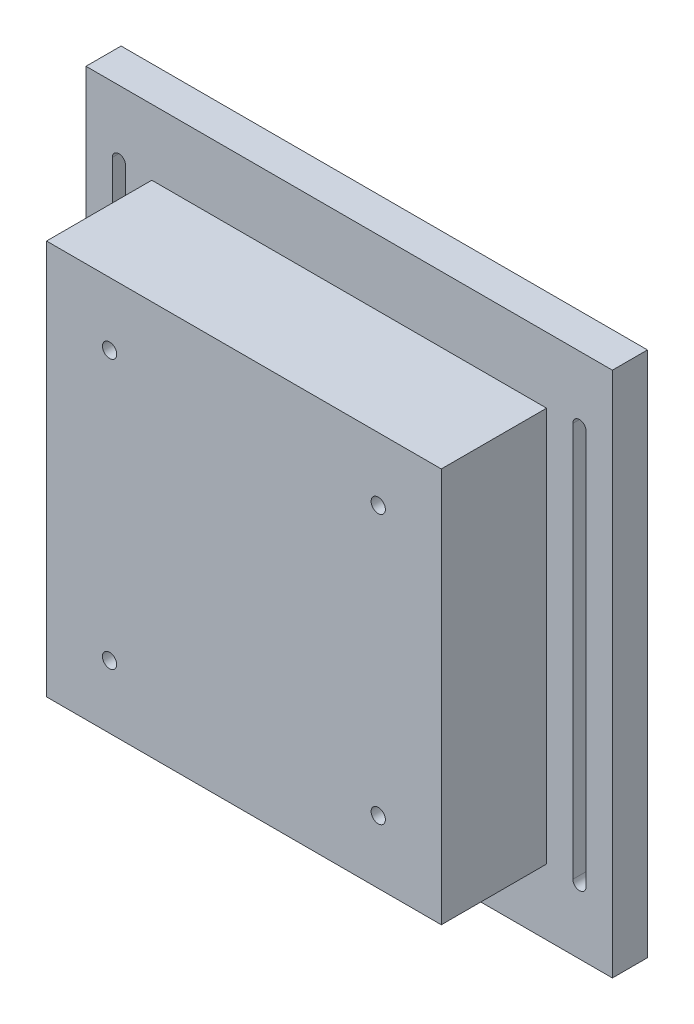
ISO-10303-21;
HEADER;
FILE_DESCRIPTION(('STEP AP214'),'2;1');
FILE_NAME('part.step','',(''),(''),'','','');
FILE_SCHEMA(('AUTOMOTIVE_DESIGN { 1 0 10303 214 1 1 1 1 }'));
ENDSEC;
DATA;
#1=APPLICATION_CONTEXT('core data for automotive mechanical design processes');
#2=APPLICATION_PROTOCOL_DEFINITION('international standard','automotive_design',2000,#1);
#3=PRODUCT_CONTEXT('',#1,'mechanical');
#4=PRODUCT('Part','Part','',(#3));
#5=PRODUCT_RELATED_PRODUCT_CATEGORY('part','',(#4));
#6=PRODUCT_DEFINITION_FORMATION('','',#4);
#7=PRODUCT_DEFINITION_CONTEXT('part definition',#1,'design');
#8=PRODUCT_DEFINITION('design','',#6,#7);
#9=PRODUCT_DEFINITION_SHAPE('','',#8);
#10=(LENGTH_UNIT() NAMED_UNIT(*) SI_UNIT(.MILLI.,.METRE.));
#11=(NAMED_UNIT(*) PLANE_ANGLE_UNIT() SI_UNIT($,.RADIAN.));
#12=(NAMED_UNIT(*) SI_UNIT($,.STERADIAN.) SOLID_ANGLE_UNIT());
#13=UNCERTAINTY_MEASURE_WITH_UNIT(LENGTH_MEASURE(1.E-05),#10,'distance_accuracy_value','');
#14=(GEOMETRIC_REPRESENTATION_CONTEXT(3) GLOBAL_UNCERTAINTY_ASSIGNED_CONTEXT((#13)) GLOBAL_UNIT_ASSIGNED_CONTEXT((#10,
#11,#12)) REPRESENTATION_CONTEXT('',''));
#15=CARTESIAN_POINT('',(0.,0.,0.));
#16=DIRECTION('',(0.,0.,1.));
#17=DIRECTION('',(1.,0.,0.));
#18=AXIS2_PLACEMENT_3D('',#15,#16,#17);
#19=CARTESIAN_POINT('',(0.,0.,16.));
#20=DIRECTION('',(0.,0.,-1.));
#21=DIRECTION('',(-1.,0.,0.));
#22=AXIS2_PLACEMENT_3D('',#19,#20,#21);
#23=PLANE('',#22);
#24=DIRECTION('',(0.,-1.,0.));
#25=VECTOR('',#24,1.);
#26=CARTESIAN_POINT('',(222.,210.,16.));
#27=LINE('',#26,#25);
#28=CARTESIAN_POINT('',(222.,210.,16.));
#29=VERTEX_POINT('',#28);
#30=CARTESIAN_POINT('',(222.,30.,16.));
#31=VERTEX_POINT('',#30);
#32=EDGE_CURVE('E189',#29,#31,#27,.T.);
#33=ORIENTED_EDGE('',*,*,#32,.F.);
#34=CARTESIAN_POINT('',(225.,210.,16.));
#35=DIRECTION('',(0.,0.,1.));
#36=DIRECTION('',(-1.,0.,0.));
#37=AXIS2_PLACEMENT_3D('',#34,#35,#36);
#38=CIRCLE('',#37,3.);
#39=CARTESIAN_POINT('',(228.,210.,16.));
#40=VERTEX_POINT('',#39);
#41=EDGE_CURVE('E48',#40,#29,#38,.T.);
#42=ORIENTED_EDGE('',*,*,#41,.F.);
#43=DIRECTION('',(0.,1.,0.));
#44=VECTOR('',#43,1.);
#45=CARTESIAN_POINT('',(228.,210.,16.));
#46=LINE('',#45,#44);
#47=CARTESIAN_POINT('',(228.,30.,16.));
#48=VERTEX_POINT('',#47);
#49=EDGE_CURVE('E182',#48,#40,#46,.T.);
#50=ORIENTED_EDGE('',*,*,#49,.F.);
#51=CARTESIAN_POINT('',(225.,30.,16.));
#52=DIRECTION('',(0.,0.,1.));
#53=DIRECTION('',(-1.,0.,0.));
#54=AXIS2_PLACEMENT_3D('',#51,#52,#53);
#55=CIRCLE('',#54,3.);
#56=EDGE_CURVE('E196',#31,#48,#55,.T.);
#57=ORIENTED_EDGE('',*,*,#56,.F.);
#58=EDGE_LOOP('',(#33,#42,#50,#57));
#59=FACE_BOUND('',#58,.T.);
#60=DIRECTION('',(0.,-1.,0.));
#61=VECTOR('',#60,1.);
#62=CARTESIAN_POINT('',(12.,210.,16.));
#63=LINE('',#62,#61);
#64=CARTESIAN_POINT('',(12.,210.,16.));
#65=VERTEX_POINT('',#64);
#66=CARTESIAN_POINT('',(12.,30.,16.));
#67=VERTEX_POINT('',#66);
#68=EDGE_CURVE('E215',#65,#67,#63,.T.);
#69=ORIENTED_EDGE('',*,*,#68,.F.);
#70=CARTESIAN_POINT('',(15.,210.,16.));
#71=DIRECTION('',(0.,0.,1.));
#72=DIRECTION('',(1.,0.,0.));
#73=AXIS2_PLACEMENT_3D('',#70,#71,#72);
#74=CIRCLE('',#73,3.);
#75=CARTESIAN_POINT('',(18.,210.,16.));
#76=VERTEX_POINT('',#75);
#77=EDGE_CURVE('E213',#76,#65,#74,.T.);
#78=ORIENTED_EDGE('',*,*,#77,.F.);
#79=DIRECTION('',(0.,1.,0.));
#80=VECTOR('',#79,1.);
#81=CARTESIAN_POINT('',(18.,210.,16.));
#82=LINE('',#81,#80);
#83=CARTESIAN_POINT('',(18.,30.,16.));
#84=VERTEX_POINT('',#83);
#85=EDGE_CURVE('E221',#84,#76,#82,.T.);
#86=ORIENTED_EDGE('',*,*,#85,.F.);
#87=CARTESIAN_POINT('',(15.,30.,16.));
#88=DIRECTION('',(0.,0.,1.));
#89=DIRECTION('',(1.,0.,0.));
#90=AXIS2_PLACEMENT_3D('',#87,#88,#89);
#91=CIRCLE('',#90,3.);
#92=EDGE_CURVE('E218',#67,#84,#91,.T.);
#93=ORIENTED_EDGE('',*,*,#92,.F.);
#94=EDGE_LOOP('',(#69,#78,#86,#93));
#95=FACE_BOUND('',#94,.T.);
#96=DIRECTION('',(0.,-1.,0.));
#97=VECTOR('',#96,1.);
#98=CARTESIAN_POINT('',(0.,0.,16.));
#99=LINE('',#98,#97);
#100=CARTESIAN_POINT('',(0.,240.,16.));
#101=VERTEX_POINT('',#100);
#102=CARTESIAN_POINT('',(0.,0.,16.));
#103=VERTEX_POINT('',#102);
#104=EDGE_CURVE('E302',#101,#103,#99,.T.);
#105=ORIENTED_EDGE('',*,*,#104,.T.);
#106=DIRECTION('',(1.,0.,0.));
#107=VECTOR('',#106,1.);
#108=CARTESIAN_POINT('',(0.,0.,16.));
#109=LINE('',#108,#107);
#110=CARTESIAN_POINT('',(240.,0.,16.));
#111=VERTEX_POINT('',#110);
#112=EDGE_CURVE('E305',#103,#111,#109,.T.);
#113=ORIENTED_EDGE('',*,*,#112,.T.);
#114=DIRECTION('',(0.,1.,0.));
#115=VECTOR('',#114,1.);
#116=CARTESIAN_POINT('',(240.,0.,16.));
#117=LINE('',#116,#115);
#118=CARTESIAN_POINT('',(240.,240.,16.));
#119=VERTEX_POINT('',#118);
#120=EDGE_CURVE('E308',#111,#119,#117,.T.);
#121=ORIENTED_EDGE('',*,*,#120,.T.);
#122=DIRECTION('',(-1.,0.,0.));
#123=VECTOR('',#122,1.);
#124=CARTESIAN_POINT('',(0.,240.,16.));
#125=LINE('',#124,#123);
#126=EDGE_CURVE('E310',#119,#101,#125,.T.);
#127=ORIENTED_EDGE('',*,*,#126,.T.);
#128=EDGE_LOOP('',(#105,#113,#121,#127));
#129=FACE_BOUND('',#128,.T.);
#130=DIRECTION('',(0.,-1.,0.));
#131=VECTOR('',#130,1.);
#132=CARTESIAN_POINT('',(30.,30.,16.));
#133=LINE('',#132,#131);
#134=CARTESIAN_POINT('',(30.,210.,16.));
#135=VERTEX_POINT('',#134);
#136=CARTESIAN_POINT('',(30.,30.,16.));
#137=VERTEX_POINT('',#136);
#138=EDGE_CURVE('E262',#135,#137,#133,.T.);
#139=ORIENTED_EDGE('',*,*,#138,.F.);
#140=DIRECTION('',(-1.,0.,0.));
#141=VECTOR('',#140,1.);
#142=CARTESIAN_POINT('',(30.,210.,16.));
#143=LINE('',#142,#141);
#144=CARTESIAN_POINT('',(210.,210.,16.));
#145=VERTEX_POINT('',#144);
#146=EDGE_CURVE('E273',#145,#135,#143,.T.);
#147=ORIENTED_EDGE('',*,*,#146,.F.);
#148=DIRECTION('',(0.,1.,0.));
#149=VECTOR('',#148,1.);
#150=CARTESIAN_POINT('',(210.,30.,16.));
#151=LINE('',#150,#149);
#152=CARTESIAN_POINT('',(210.,30.,16.));
#153=VERTEX_POINT('',#152);
#154=EDGE_CURVE('E285',#153,#145,#151,.T.);
#155=ORIENTED_EDGE('',*,*,#154,.F.);
#156=DIRECTION('',(1.,0.,0.));
#157=VECTOR('',#156,1.);
#158=CARTESIAN_POINT('',(30.,30.,16.));
#159=LINE('',#158,#157);
#160=EDGE_CURVE('E282',#137,#153,#159,.T.);
#161=ORIENTED_EDGE('',*,*,#160,.F.);
#162=EDGE_LOOP('',(#139,#147,#155,#161));
#163=FACE_BOUND('',#162,.T.);
#164=ADVANCED_FACE('F33',(#59,#95,#129,#163),#23,.F.);
#165=CARTESIAN_POINT('',(0.,0.,16.));
#166=DIRECTION('',(1.,0.,0.));
#167=DIRECTION('',(0.,0.,-1.));
#168=AXIS2_PLACEMENT_3D('',#165,#166,#167);
#169=PLANE('',#168);
#170=DIRECTION('',(0.,-1.,0.));
#171=VECTOR('',#170,1.);
#172=CARTESIAN_POINT('',(0.,0.,0.));
#173=LINE('',#172,#171);
#174=CARTESIAN_POINT('',(0.,240.,0.));
#175=VERTEX_POINT('',#174);
#176=CARTESIAN_POINT('',(0.,0.,0.));
#177=VERTEX_POINT('',#176);
#178=EDGE_CURVE('E301',#175,#177,#173,.T.);
#179=ORIENTED_EDGE('',*,*,#178,.T.);
#180=DIRECTION('',(0.,0.,-1.));
#181=VECTOR('',#180,1.);
#182=CARTESIAN_POINT('',(0.,0.,16.));
#183=LINE('',#182,#181);
#184=EDGE_CURVE('E11',#103,#177,#183,.T.);
#185=ORIENTED_EDGE('',*,*,#184,.F.);
#186=ORIENTED_EDGE('',*,*,#104,.F.);
#187=DIRECTION('',(0.,0.,-1.));
#188=VECTOR('',#187,1.);
#189=CARTESIAN_POINT('',(0.,240.,16.));
#190=LINE('',#189,#188);
#191=EDGE_CURVE('E312',#101,#175,#190,.T.);
#192=ORIENTED_EDGE('',*,*,#191,.T.);
#193=EDGE_LOOP('',(#179,#185,#186,#192));
#194=FACE_BOUND('',#193,.T.);
#195=ADVANCED_FACE('F35',(#194),#169,.F.);
#196=CARTESIAN_POINT('',(0.,0.,16.));
#197=DIRECTION('',(0.,1.,0.));
#198=DIRECTION('',(0.,0.,1.));
#199=AXIS2_PLACEMENT_3D('',#196,#197,#198);
#200=PLANE('',#199);
#201=DIRECTION('',(1.,0.,0.));
#202=VECTOR('',#201,1.);
#203=CARTESIAN_POINT('',(0.,0.,0.));
#204=LINE('',#203,#202);
#205=CARTESIAN_POINT('',(240.,0.,0.));
#206=VERTEX_POINT('',#205);
#207=EDGE_CURVE('E315',#177,#206,#204,.T.);
#208=ORIENTED_EDGE('',*,*,#207,.T.);
#209=DIRECTION('',(0.,0.,-1.));
#210=VECTOR('',#209,1.);
#211=CARTESIAN_POINT('',(240.,0.,16.));
#212=LINE('',#211,#210);
#213=EDGE_CURVE('E41',#111,#206,#212,.T.);
#214=ORIENTED_EDGE('',*,*,#213,.F.);
#215=ORIENTED_EDGE('',*,*,#112,.F.);
#216=ORIENTED_EDGE('',*,*,#184,.T.);
#217=EDGE_LOOP('',(#208,#214,#215,#216));
#218=FACE_BOUND('',#217,.T.);
#219=ADVANCED_FACE('F344',(#218),#200,.F.);
#220=CARTESIAN_POINT('',(240.,0.,16.));
#221=DIRECTION('',(-1.,0.,0.));
#222=DIRECTION('',(0.,0.,1.));
#223=AXIS2_PLACEMENT_3D('',#220,#221,#222);
#224=PLANE('',#223);
#225=DIRECTION('',(0.,1.,0.));
#226=VECTOR('',#225,1.);
#227=CARTESIAN_POINT('',(240.,0.,0.));
#228=LINE('',#227,#226);
#229=CARTESIAN_POINT('',(240.,240.,0.));
#230=VERTEX_POINT('',#229);
#231=EDGE_CURVE('E317',#206,#230,#228,.T.);
#232=ORIENTED_EDGE('',*,*,#231,.T.);
#233=DIRECTION('',(0.,0.,-1.));
#234=VECTOR('',#233,1.);
#235=CARTESIAN_POINT('',(240.,240.,16.));
#236=LINE('',#235,#234);
#237=EDGE_CURVE('E322',#119,#230,#236,.T.);
#238=ORIENTED_EDGE('',*,*,#237,.F.);
#239=ORIENTED_EDGE('',*,*,#120,.F.);
#240=ORIENTED_EDGE('',*,*,#213,.T.);
#241=EDGE_LOOP('',(#232,#238,#239,#240));
#242=FACE_BOUND('',#241,.T.);
#243=ADVANCED_FACE('F329',(#242),#224,.F.);
#244=CARTESIAN_POINT('',(0.,240.,16.));
#245=DIRECTION('',(0.,-1.,0.));
#246=DIRECTION('',(0.,0.,-1.));
#247=AXIS2_PLACEMENT_3D('',#244,#245,#246);
#248=PLANE('',#247);
#249=DIRECTION('',(-1.,0.,0.));
#250=VECTOR('',#249,1.);
#251=CARTESIAN_POINT('',(0.,240.,0.));
#252=LINE('',#251,#250);
#253=EDGE_CURVE('E306',#230,#175,#252,.T.);
#254=ORIENTED_EDGE('',*,*,#253,.T.);
#255=ORIENTED_EDGE('',*,*,#191,.F.);
#256=ORIENTED_EDGE('',*,*,#126,.F.);
#257=ORIENTED_EDGE('',*,*,#237,.T.);
#258=EDGE_LOOP('',(#254,#255,#256,#257));
#259=FACE_BOUND('',#258,.T.);
#260=ADVANCED_FACE('F337',(#259),#248,.F.);
#261=CARTESIAN_POINT('',(0.,0.,0.));
#262=DIRECTION('',(0.,0.,-1.));
#263=DIRECTION('',(-1.,0.,0.));
#264=AXIS2_PLACEMENT_3D('',#261,#262,#263);
#265=PLANE('',#264);
#266=CARTESIAN_POINT('',(225.,210.,0.));
#267=DIRECTION('',(0.,0.,-1.));
#268=DIRECTION('',(-1.,0.,0.));
#269=AXIS2_PLACEMENT_3D('',#266,#267,#268);
#270=CIRCLE('',#269,3.);
#271=CARTESIAN_POINT('',(228.,210.,0.));
#272=VERTEX_POINT('',#271);
#273=CARTESIAN_POINT('',(222.,210.,0.));
#274=VERTEX_POINT('',#273);
#275=EDGE_CURVE('E180',#272,#274,#270,.F.);
#276=ORIENTED_EDGE('',*,*,#275,.T.);
#277=DIRECTION('',(0.,-1.,0.));
#278=VECTOR('',#277,1.);
#279=CARTESIAN_POINT('',(222.,210.,0.));
#280=LINE('',#279,#278);
#281=CARTESIAN_POINT('',(222.,30.,0.));
#282=VERTEX_POINT('',#281);
#283=EDGE_CURVE('E169',#274,#282,#280,.T.);
#284=ORIENTED_EDGE('',*,*,#283,.T.);
#285=CARTESIAN_POINT('',(225.,30.,0.));
#286=DIRECTION('',(0.,0.,-1.));
#287=DIRECTION('',(-1.,0.,0.));
#288=AXIS2_PLACEMENT_3D('',#285,#286,#287);
#289=CIRCLE('',#288,3.);
#290=CARTESIAN_POINT('',(228.,30.,0.));
#291=VERTEX_POINT('',#290);
#292=EDGE_CURVE('E191',#282,#291,#289,.F.);
#293=ORIENTED_EDGE('',*,*,#292,.T.);
#294=DIRECTION('',(0.,1.,0.));
#295=VECTOR('',#294,1.);
#296=CARTESIAN_POINT('',(228.,210.,0.));
#297=LINE('',#296,#295);
#298=EDGE_CURVE('E187',#291,#272,#297,.T.);
#299=ORIENTED_EDGE('',*,*,#298,.T.);
#300=EDGE_LOOP('',(#276,#284,#293,#299));
#301=FACE_BOUND('',#300,.T.);
#302=CARTESIAN_POINT('',(15.,210.,0.));
#303=DIRECTION('',(0.,0.,-1.));
#304=DIRECTION('',(-1.,0.,0.));
#305=AXIS2_PLACEMENT_3D('',#302,#303,#304);
#306=CIRCLE('',#305,3.);
#307=CARTESIAN_POINT('',(18.,210.,0.));
#308=VERTEX_POINT('',#307);
#309=CARTESIAN_POINT('',(12.,210.,0.));
#310=VERTEX_POINT('',#309);
#311=EDGE_CURVE('E210',#308,#310,#306,.F.);
#312=ORIENTED_EDGE('',*,*,#311,.T.);
#313=DIRECTION('',(0.,-1.,0.));
#314=VECTOR('',#313,1.);
#315=CARTESIAN_POINT('',(12.,210.,0.));
#316=LINE('',#315,#314);
#317=CARTESIAN_POINT('',(12.,30.,0.));
#318=VERTEX_POINT('',#317);
#319=EDGE_CURVE('E227',#310,#318,#316,.T.);
#320=ORIENTED_EDGE('',*,*,#319,.T.);
#321=CARTESIAN_POINT('',(15.,30.,0.));
#322=DIRECTION('',(0.,0.,-1.));
#323=DIRECTION('',(-1.,0.,0.));
#324=AXIS2_PLACEMENT_3D('',#321,#322,#323);
#325=CIRCLE('',#324,3.);
#326=CARTESIAN_POINT('',(18.,30.,0.));
#327=VERTEX_POINT('',#326);
#328=EDGE_CURVE('E176',#318,#327,#325,.F.);
#329=ORIENTED_EDGE('',*,*,#328,.T.);
#330=DIRECTION('',(0.,1.,0.));
#331=VECTOR('',#330,1.);
#332=CARTESIAN_POINT('',(18.,210.,0.));
#333=LINE('',#332,#331);
#334=EDGE_CURVE('E207',#327,#308,#333,.T.);
#335=ORIENTED_EDGE('',*,*,#334,.T.);
#336=EDGE_LOOP('',(#312,#320,#329,#335));
#337=FACE_BOUND('',#336,.T.);
#338=DIRECTION('',(0.,-1.,0.));
#339=VECTOR('',#338,1.);
#340=CARTESIAN_POINT('',(200.,200.,0.));
#341=LINE('',#340,#339);
#342=CARTESIAN_POINT('',(200.,200.,0.));
#343=VERTEX_POINT('',#342);
#344=CARTESIAN_POINT('',(200.,40.,0.));
#345=VERTEX_POINT('',#344);
#346=EDGE_CURVE('E236',#343,#345,#341,.T.);
#347=ORIENTED_EDGE('',*,*,#346,.F.);
#348=DIRECTION('',(1.,0.,0.));
#349=VECTOR('',#348,1.);
#350=CARTESIAN_POINT('',(200.,200.,0.));
#351=LINE('',#350,#349);
#352=CARTESIAN_POINT('',(40.,200.,0.));
#353=VERTEX_POINT('',#352);
#354=EDGE_CURVE('E241',#353,#343,#351,.T.);
#355=ORIENTED_EDGE('',*,*,#354,.F.);
#356=DIRECTION('',(0.,1.,0.));
#357=VECTOR('',#356,1.);
#358=CARTESIAN_POINT('',(40.,200.,0.));
#359=LINE('',#358,#357);
#360=CARTESIAN_POINT('',(40.0000000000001,40.,0.));
#361=VERTEX_POINT('',#360);
#362=EDGE_CURVE('E255',#361,#353,#359,.T.);
#363=ORIENTED_EDGE('',*,*,#362,.F.);
#364=DIRECTION('',(-1.,0.,0.));
#365=VECTOR('',#364,1.);
#366=CARTESIAN_POINT('',(200.,40.,0.));
#367=LINE('',#366,#365);
#368=EDGE_CURVE('E252',#345,#361,#367,.T.);
#369=ORIENTED_EDGE('',*,*,#368,.F.);
#370=EDGE_LOOP('',(#347,#355,#363,#369));
#371=FACE_BOUND('',#370,.T.);
#372=ORIENTED_EDGE('',*,*,#178,.F.);
#373=ORIENTED_EDGE('',*,*,#253,.F.);
#374=ORIENTED_EDGE('',*,*,#231,.F.);
#375=ORIENTED_EDGE('',*,*,#207,.F.);
#376=EDGE_LOOP('',(#372,#373,#374,#375));
#377=FACE_BOUND('',#376,.T.);
#378=ADVANCED_FACE('F185',(#301,#337,#371,#377),#265,.T.);
#379=CARTESIAN_POINT('',(30.,30.,64.));
#380=DIRECTION('',(1.,0.,0.));
#381=DIRECTION('',(0.,0.,-1.));
#382=AXIS2_PLACEMENT_3D('',#379,#380,#381);
#383=PLANE('',#382);
#384=ORIENTED_EDGE('',*,*,#138,.T.);
#385=DIRECTION('',(0.,0.,-1.));
#386=VECTOR('',#385,1.);
#387=CARTESIAN_POINT('',(30.,30.,64.));
#388=LINE('',#387,#386);
#389=CARTESIAN_POINT('',(30.,30.,64.));
#390=VERTEX_POINT('',#389);
#391=EDGE_CURVE('E298',#390,#137,#388,.T.);
#392=ORIENTED_EDGE('',*,*,#391,.F.);
#393=DIRECTION('',(0.,-1.,0.));
#394=VECTOR('',#393,1.);
#395=CARTESIAN_POINT('',(30.,30.,64.));
#396=LINE('',#395,#394);
#397=CARTESIAN_POINT('',(30.,210.,64.));
#398=VERTEX_POINT('',#397);
#399=EDGE_CURVE('E269',#398,#390,#396,.T.);
#400=ORIENTED_EDGE('',*,*,#399,.F.);
#401=DIRECTION('',(0.,0.,-1.));
#402=VECTOR('',#401,1.);
#403=CARTESIAN_POINT('',(30.,210.,64.));
#404=LINE('',#403,#402);
#405=EDGE_CURVE('E279',#398,#135,#404,.T.);
#406=ORIENTED_EDGE('',*,*,#405,.T.);
#407=EDGE_LOOP('',(#384,#392,#400,#406));
#408=FACE_BOUND('',#407,.T.);
#409=ADVANCED_FACE('F359',(#408),#383,.F.);
#410=CARTESIAN_POINT('',(30.,30.,64.));
#411=DIRECTION('',(0.,1.,0.));
#412=DIRECTION('',(-1.,0.,0.));
#413=AXIS2_PLACEMENT_3D('',#410,#411,#412);
#414=PLANE('',#413);
#415=ORIENTED_EDGE('',*,*,#160,.T.);
#416=DIRECTION('',(0.,0.,-1.));
#417=VECTOR('',#416,1.);
#418=CARTESIAN_POINT('',(210.,30.,64.));
#419=LINE('',#418,#417);
#420=CARTESIAN_POINT('',(210.,30.,64.));
#421=VERTEX_POINT('',#420);
#422=EDGE_CURVE('E295',#421,#153,#419,.T.);
#423=ORIENTED_EDGE('',*,*,#422,.F.);
#424=DIRECTION('',(1.,0.,0.));
#425=VECTOR('',#424,1.);
#426=CARTESIAN_POINT('',(30.,30.,64.));
#427=LINE('',#426,#425);
#428=EDGE_CURVE('E272',#390,#421,#427,.T.);
#429=ORIENTED_EDGE('',*,*,#428,.F.);
#430=ORIENTED_EDGE('',*,*,#391,.T.);
#431=EDGE_LOOP('',(#415,#423,#429,#430));
#432=FACE_BOUND('',#431,.T.);
#433=ADVANCED_FACE('F379',(#432),#414,.F.);
#434=CARTESIAN_POINT('',(210.,30.,64.));
#435=DIRECTION('',(-1.,0.,0.));
#436=DIRECTION('',(0.,0.,1.));
#437=AXIS2_PLACEMENT_3D('',#434,#435,#436);
#438=PLANE('',#437);
#439=ORIENTED_EDGE('',*,*,#154,.T.);
#440=DIRECTION('',(0.,0.,-1.));
#441=VECTOR('',#440,1.);
#442=CARTESIAN_POINT('',(210.,210.,64.));
#443=LINE('',#442,#441);
#444=CARTESIAN_POINT('',(210.,210.,64.));
#445=VERTEX_POINT('',#444);
#446=EDGE_CURVE('E292',#445,#145,#443,.T.);
#447=ORIENTED_EDGE('',*,*,#446,.F.);
#448=DIRECTION('',(0.,1.,0.));
#449=VECTOR('',#448,1.);
#450=CARTESIAN_POINT('',(210.,30.,64.));
#451=LINE('',#450,#449);
#452=EDGE_CURVE('E275',#421,#445,#451,.T.);
#453=ORIENTED_EDGE('',*,*,#452,.F.);
#454=ORIENTED_EDGE('',*,*,#422,.T.);
#455=EDGE_LOOP('',(#439,#447,#453,#454));
#456=FACE_BOUND('',#455,.T.);
#457=ADVANCED_FACE('F386',(#456),#438,.F.);
#458=CARTESIAN_POINT('',(30.,210.,64.));
#459=DIRECTION('',(0.,-1.,0.));
#460=DIRECTION('',(1.,0.,0.));
#461=AXIS2_PLACEMENT_3D('',#458,#459,#460);
#462=PLANE('',#461);
#463=ORIENTED_EDGE('',*,*,#146,.T.);
#464=ORIENTED_EDGE('',*,*,#405,.F.);
#465=DIRECTION('',(-1.,0.,0.));
#466=VECTOR('',#465,1.);
#467=CARTESIAN_POINT('',(30.,210.,64.));
#468=LINE('',#467,#466);
#469=EDGE_CURVE('E277',#445,#398,#468,.T.);
#470=ORIENTED_EDGE('',*,*,#469,.F.);
#471=ORIENTED_EDGE('',*,*,#446,.T.);
#472=EDGE_LOOP('',(#463,#464,#470,#471));
#473=FACE_BOUND('',#472,.T.);
#474=ADVANCED_FACE('F393',(#473),#462,.F.);
#475=CARTESIAN_POINT('',(0.,0.,64.));
#476=DIRECTION('',(0.,0.,-1.));
#477=DIRECTION('',(-1.,0.,0.));
#478=AXIS2_PLACEMENT_3D('',#475,#476,#477);
#479=PLANE('',#478);
#480=CARTESIAN_POINT('',(58.7500000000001,181.25,64.));
#481=DIRECTION('',(0.,0.,1.));
#482=DIRECTION('',(-1.,0.,0.));
#483=AXIS2_PLACEMENT_3D('',#480,#481,#482);
#484=CIRCLE('',#483,3.25000000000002);
#485=CARTESIAN_POINT('',(55.5,181.25,64.));
#486=VERTEX_POINT('',#485);
#487=EDGE_CURVE('E615',#486,#486,#484,.T.);
#488=ORIENTED_EDGE('',*,*,#487,.F.);
#489=EDGE_LOOP('',(#488));
#490=FACE_BOUND('',#489,.T.);
#491=CARTESIAN_POINT('',(58.75,58.75,64.));
#492=DIRECTION('',(0.,0.,1.));
#493=DIRECTION('',(1.,0.,0.));
#494=AXIS2_PLACEMENT_3D('',#491,#492,#493);
#495=CIRCLE('',#494,3.25000000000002);
#496=CARTESIAN_POINT('',(62.,58.75,64.));
#497=VERTEX_POINT('',#496);
#498=EDGE_CURVE('E621',#497,#497,#495,.T.);
#499=ORIENTED_EDGE('',*,*,#498,.F.);
#500=EDGE_LOOP('',(#499));
#501=FACE_BOUND('',#500,.T.);
#502=CARTESIAN_POINT('',(181.25,58.7499999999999,64.));
#503=DIRECTION('',(0.,0.,1.));
#504=DIRECTION('',(-1.,0.,0.));
#505=AXIS2_PLACEMENT_3D('',#502,#503,#504);
#506=CIRCLE('',#505,3.25000000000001);
#507=CARTESIAN_POINT('',(178.,58.7499999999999,64.));
#508=VERTEX_POINT('',#507);
#509=EDGE_CURVE('E629',#508,#508,#506,.T.);
#510=ORIENTED_EDGE('',*,*,#509,.F.);
#511=EDGE_LOOP('',(#510));
#512=FACE_BOUND('',#511,.T.);
#513=CARTESIAN_POINT('',(181.25,181.25,64.));
#514=DIRECTION('',(0.,0.,1.));
#515=DIRECTION('',(1.,0.,0.));
#516=AXIS2_PLACEMENT_3D('',#513,#514,#515);
#517=CIRCLE('',#516,3.25000000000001);
#518=CARTESIAN_POINT('',(184.5,181.25,64.));
#519=VERTEX_POINT('',#518);
#520=EDGE_CURVE('E619',#519,#519,#517,.T.);
#521=ORIENTED_EDGE('',*,*,#520,.F.);
#522=EDGE_LOOP('',(#521));
#523=FACE_BOUND('',#522,.T.);
#524=ORIENTED_EDGE('',*,*,#399,.T.);
#525=ORIENTED_EDGE('',*,*,#428,.T.);
#526=ORIENTED_EDGE('',*,*,#452,.T.);
#527=ORIENTED_EDGE('',*,*,#469,.T.);
#528=EDGE_LOOP('',(#524,#525,#526,#527));
#529=FACE_BOUND('',#528,.T.);
#530=ADVANCED_FACE('F401',(#490,#501,#512,#523,#529),#479,.F.);
#531=CARTESIAN_POINT('',(200.,200.,48.));
#532=DIRECTION('',(1.,0.,0.));
#533=DIRECTION('',(0.,1.,0.));
#534=AXIS2_PLACEMENT_3D('',#531,#532,#533);
#535=PLANE('',#534);
#536=ORIENTED_EDGE('',*,*,#346,.T.);
#537=DIRECTION('',(0.,0.,-1.));
#538=VECTOR('',#537,1.);
#539=CARTESIAN_POINT('',(200.,40.,48.));
#540=LINE('',#539,#538);
#541=CARTESIAN_POINT('',(200.,40.,48.));
#542=VERTEX_POINT('',#541);
#543=EDGE_CURVE('E250',#542,#345,#540,.T.);
#544=ORIENTED_EDGE('',*,*,#543,.F.);
#545=DIRECTION('',(0.,-1.,0.));
#546=VECTOR('',#545,1.);
#547=CARTESIAN_POINT('',(200.,200.,48.));
#548=LINE('',#547,#546);
#549=CARTESIAN_POINT('',(200.,200.,48.));
#550=VERTEX_POINT('',#549);
#551=EDGE_CURVE('E237',#550,#542,#548,.T.);
#552=ORIENTED_EDGE('',*,*,#551,.F.);
#553=DIRECTION('',(0.,0.,-1.));
#554=VECTOR('',#553,1.);
#555=CARTESIAN_POINT('',(200.,200.,48.));
#556=LINE('',#555,#554);
#557=EDGE_CURVE('E260',#550,#343,#556,.T.);
#558=ORIENTED_EDGE('',*,*,#557,.T.);
#559=EDGE_LOOP('',(#536,#544,#552,#558));
#560=FACE_BOUND('',#559,.T.);
#561=ADVANCED_FACE('F410',(#560),#535,.F.);
#562=CARTESIAN_POINT('',(200.,200.,48.));
#563=DIRECTION('',(0.,1.,0.));
#564=DIRECTION('',(-1.,0.,0.));
#565=AXIS2_PLACEMENT_3D('',#562,#563,#564);
#566=PLANE('',#565);
#567=ORIENTED_EDGE('',*,*,#354,.T.);
#568=ORIENTED_EDGE('',*,*,#557,.F.);
#569=DIRECTION('',(1.,0.,0.));
#570=VECTOR('',#569,1.);
#571=CARTESIAN_POINT('',(200.,200.,48.));
#572=LINE('',#571,#570);
#573=CARTESIAN_POINT('',(40.,200.,48.));
#574=VERTEX_POINT('',#573);
#575=EDGE_CURVE('E247',#574,#550,#572,.T.);
#576=ORIENTED_EDGE('',*,*,#575,.F.);
#577=DIRECTION('',(0.,0.,-1.));
#578=VECTOR('',#577,1.);
#579=CARTESIAN_POINT('',(40.,200.,48.));
#580=LINE('',#579,#578);
#581=EDGE_CURVE('E263',#574,#353,#580,.T.);
#582=ORIENTED_EDGE('',*,*,#581,.T.);
#583=EDGE_LOOP('',(#567,#568,#576,#582));
#584=FACE_BOUND('',#583,.T.);
#585=ADVANCED_FACE('F419',(#584),#566,.F.);
#586=CARTESIAN_POINT('',(40.,200.,48.));
#587=DIRECTION('',(-1.,0.,0.));
#588=DIRECTION('',(0.,-1.,0.));
#589=AXIS2_PLACEMENT_3D('',#586,#587,#588);
#590=PLANE('',#589);
#591=ORIENTED_EDGE('',*,*,#362,.T.);
#592=ORIENTED_EDGE('',*,*,#581,.F.);
#593=DIRECTION('',(0.,1.,0.));
#594=VECTOR('',#593,1.);
#595=CARTESIAN_POINT('',(40.,200.,48.));
#596=LINE('',#595,#594);
#597=CARTESIAN_POINT('',(40.0000000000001,40.,48.));
#598=VERTEX_POINT('',#597);
#599=EDGE_CURVE('E244',#598,#574,#596,.T.);
#600=ORIENTED_EDGE('',*,*,#599,.F.);
#601=DIRECTION('',(0.,0.,-1.));
#602=VECTOR('',#601,1.);
#603=CARTESIAN_POINT('',(40.0000000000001,40.,48.));
#604=LINE('',#603,#602);
#605=EDGE_CURVE('E265',#598,#361,#604,.T.);
#606=ORIENTED_EDGE('',*,*,#605,.T.);
#607=EDGE_LOOP('',(#591,#592,#600,#606));
#608=FACE_BOUND('',#607,.T.);
#609=ADVANCED_FACE('F427',(#608),#590,.F.);
#610=CARTESIAN_POINT('',(200.,40.,48.));
#611=DIRECTION('',(0.,-1.,0.));
#612=DIRECTION('',(1.,0.,0.));
#613=AXIS2_PLACEMENT_3D('',#610,#611,#612);
#614=PLANE('',#613);
#615=ORIENTED_EDGE('',*,*,#368,.T.);
#616=ORIENTED_EDGE('',*,*,#605,.F.);
#617=DIRECTION('',(-1.,0.,0.));
#618=VECTOR('',#617,1.);
#619=CARTESIAN_POINT('',(200.,40.,48.));
#620=LINE('',#619,#618);
#621=EDGE_CURVE('E240',#542,#598,#620,.T.);
#622=ORIENTED_EDGE('',*,*,#621,.F.);
#623=ORIENTED_EDGE('',*,*,#543,.T.);
#624=EDGE_LOOP('',(#615,#616,#622,#623));
#625=FACE_BOUND('',#624,.T.);
#626=ADVANCED_FACE('F435',(#625),#614,.F.);
#627=CARTESIAN_POINT('',(0.,0.,48.));
#628=DIRECTION('',(0.,0.,-1.));
#629=DIRECTION('',(-1.,0.,0.));
#630=AXIS2_PLACEMENT_3D('',#627,#628,#629);
#631=PLANE('',#630);
#632=CARTESIAN_POINT('',(58.7500000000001,181.25,48.));
#633=DIRECTION('',(0.,0.,-1.));
#634=DIRECTION('',(-1.,0.,0.));
#635=AXIS2_PLACEMENT_3D('',#632,#633,#634);
#636=CIRCLE('',#635,3.25000000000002);
#637=CARTESIAN_POINT('',(55.5,181.25,48.));
#638=VERTEX_POINT('',#637);
#639=EDGE_CURVE('E612',#638,#638,#636,.F.);
#640=ORIENTED_EDGE('',*,*,#639,.T.);
#641=EDGE_LOOP('',(#640));
#642=FACE_BOUND('',#641,.T.);
#643=CARTESIAN_POINT('',(58.75,58.75,48.));
#644=DIRECTION('',(0.,0.,-1.));
#645=DIRECTION('',(-1.,0.,0.));
#646=AXIS2_PLACEMENT_3D('',#643,#644,#645);
#647=CIRCLE('',#646,3.25000000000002);
#648=CARTESIAN_POINT('',(55.5,58.75,48.));
#649=VERTEX_POINT('',#648);
#650=EDGE_CURVE('E626',#649,#649,#647,.F.);
#651=ORIENTED_EDGE('',*,*,#650,.T.);
#652=EDGE_LOOP('',(#651));
#653=FACE_BOUND('',#652,.T.);
#654=CARTESIAN_POINT('',(181.25,58.7499999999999,48.));
#655=DIRECTION('',(0.,0.,-1.));
#656=DIRECTION('',(-1.,0.,0.));
#657=AXIS2_PLACEMENT_3D('',#654,#655,#656);
#658=CIRCLE('',#657,3.25000000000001);
#659=CARTESIAN_POINT('',(178.,58.7499999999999,48.));
#660=VERTEX_POINT('',#659);
#661=EDGE_CURVE('E632',#660,#660,#658,.F.);
#662=ORIENTED_EDGE('',*,*,#661,.T.);
#663=EDGE_LOOP('',(#662));
#664=FACE_BOUND('',#663,.T.);
#665=CARTESIAN_POINT('',(181.25,181.25,48.));
#666=DIRECTION('',(0.,0.,-1.));
#667=DIRECTION('',(-1.,0.,0.));
#668=AXIS2_PLACEMENT_3D('',#665,#666,#667);
#669=CIRCLE('',#668,3.25000000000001);
#670=CARTESIAN_POINT('',(178.,181.25,48.));
#671=VERTEX_POINT('',#670);
#672=EDGE_CURVE('E616',#671,#671,#669,.F.);
#673=ORIENTED_EDGE('',*,*,#672,.T.);
#674=EDGE_LOOP('',(#673));
#675=FACE_BOUND('',#674,.T.);
#676=ORIENTED_EDGE('',*,*,#551,.T.);
#677=ORIENTED_EDGE('',*,*,#621,.T.);
#678=ORIENTED_EDGE('',*,*,#599,.T.);
#679=ORIENTED_EDGE('',*,*,#575,.T.);
#680=EDGE_LOOP('',(#676,#677,#678,#679));
#681=FACE_BOUND('',#680,.T.);
#682=ADVANCED_FACE('F443',(#642,#653,#664,#675,#681),#631,.T.);
#683=CARTESIAN_POINT('',(15.,210.,-0.001000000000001));
#684=DIRECTION('',(0.,0.,1.));
#685=DIRECTION('',(1.,0.,0.));
#686=AXIS2_PLACEMENT_3D('',#683,#684,#685);
#687=CYLINDRICAL_SURFACE('',#686,3.);
#688=DIRECTION('',(0.,0.,1.));
#689=VECTOR('',#688,1.);
#690=CARTESIAN_POINT('',(18.,210.,-0.001000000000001));
#691=LINE('',#690,#689);
#692=EDGE_CURVE('E225',#308,#76,#691,.T.);
#693=ORIENTED_EDGE('',*,*,#692,.T.);
#694=ORIENTED_EDGE('',*,*,#77,.T.);
#695=DIRECTION('',(0.,0.,1.));
#696=VECTOR('',#695,1.);
#697=CARTESIAN_POINT('',(12.,210.,-0.001000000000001));
#698=LINE('',#697,#696);
#699=EDGE_CURVE('E224',#310,#65,#698,.T.);
#700=ORIENTED_EDGE('',*,*,#699,.F.);
#701=ORIENTED_EDGE('',*,*,#311,.F.);
#702=EDGE_LOOP('',(#693,#694,#700,#701));
#703=FACE_BOUND('',#702,.T.);
#704=ADVANCED_FACE('F450',(#703),#687,.F.);
#705=CARTESIAN_POINT('',(18.,210.,-0.001000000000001));
#706=DIRECTION('',(1.,0.,0.));
#707=DIRECTION('',(0.,1.,0.));
#708=AXIS2_PLACEMENT_3D('',#705,#706,#707);
#709=PLANE('',#708);
#710=DIRECTION('',(0.,0.,1.));
#711=VECTOR('',#710,1.);
#712=CARTESIAN_POINT('',(18.,30.,-0.001000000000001));
#713=LINE('',#712,#711);
#714=EDGE_CURVE('E228',#327,#84,#713,.T.);
#715=ORIENTED_EDGE('',*,*,#714,.T.);
#716=ORIENTED_EDGE('',*,*,#85,.T.);
#717=ORIENTED_EDGE('',*,*,#692,.F.);
#718=ORIENTED_EDGE('',*,*,#334,.F.);
#719=EDGE_LOOP('',(#715,#716,#717,#718));
#720=FACE_BOUND('',#719,.T.);
#721=ADVANCED_FACE('F458',(#720),#709,.F.);
#722=CARTESIAN_POINT('',(15.,30.,-0.001000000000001));
#723=DIRECTION('',(0.,0.,1.));
#724=DIRECTION('',(1.,0.,0.));
#725=AXIS2_PLACEMENT_3D('',#722,#723,#724);
#726=CYLINDRICAL_SURFACE('',#725,3.);
#727=DIRECTION('',(0.,0.,1.));
#728=VECTOR('',#727,1.);
#729=CARTESIAN_POINT('',(12.,30.,-0.001000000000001));
#730=LINE('',#729,#728);
#731=EDGE_CURVE('E230',#318,#67,#730,.T.);
#732=ORIENTED_EDGE('',*,*,#731,.T.);
#733=ORIENTED_EDGE('',*,*,#92,.T.);
#734=ORIENTED_EDGE('',*,*,#714,.F.);
#735=ORIENTED_EDGE('',*,*,#328,.F.);
#736=EDGE_LOOP('',(#732,#733,#734,#735));
#737=FACE_BOUND('',#736,.T.);
#738=ADVANCED_FACE('F466',(#737),#726,.F.);
#739=CARTESIAN_POINT('',(12.,210.,-0.001000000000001));
#740=DIRECTION('',(-1.,0.,0.));
#741=DIRECTION('',(0.,-1.,0.));
#742=AXIS2_PLACEMENT_3D('',#739,#740,#741);
#743=PLANE('',#742);
#744=ORIENTED_EDGE('',*,*,#699,.T.);
#745=ORIENTED_EDGE('',*,*,#68,.T.);
#746=ORIENTED_EDGE('',*,*,#731,.F.);
#747=ORIENTED_EDGE('',*,*,#319,.F.);
#748=EDGE_LOOP('',(#744,#745,#746,#747));
#749=FACE_BOUND('',#748,.T.);
#750=ADVANCED_FACE('F474',(#749),#743,.F.);
#751=CARTESIAN_POINT('',(225.,210.,-0.001000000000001));
#752=DIRECTION('',(0.,0.,1.));
#753=DIRECTION('',(1.,0.,0.));
#754=AXIS2_PLACEMENT_3D('',#751,#752,#753);
#755=CYLINDRICAL_SURFACE('',#754,3.);
#756=DIRECTION('',(0.,0.,1.));
#757=VECTOR('',#756,1.);
#758=CARTESIAN_POINT('',(228.,210.,-0.001000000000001));
#759=LINE('',#758,#757);
#760=EDGE_CURVE('E177',#272,#40,#759,.T.);
#761=ORIENTED_EDGE('',*,*,#760,.T.);
#762=ORIENTED_EDGE('',*,*,#41,.T.);
#763=DIRECTION('',(0.,0.,1.));
#764=VECTOR('',#763,1.);
#765=CARTESIAN_POINT('',(222.,210.,-0.001000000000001));
#766=LINE('',#765,#764);
#767=EDGE_CURVE('E171',#274,#29,#766,.T.);
#768=ORIENTED_EDGE('',*,*,#767,.F.);
#769=ORIENTED_EDGE('',*,*,#275,.F.);
#770=EDGE_LOOP('',(#761,#762,#768,#769));
#771=FACE_BOUND('',#770,.T.);
#772=ADVANCED_FACE('F179',(#771),#755,.F.);
#773=CARTESIAN_POINT('',(228.,210.,-0.001000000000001));
#774=DIRECTION('',(1.,0.,0.));
#775=DIRECTION('',(0.,1.,0.));
#776=AXIS2_PLACEMENT_3D('',#773,#774,#775);
#777=PLANE('',#776);
#778=DIRECTION('',(0.,0.,1.));
#779=VECTOR('',#778,1.);
#780=CARTESIAN_POINT('',(228.,30.,-0.001000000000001));
#781=LINE('',#780,#779);
#782=EDGE_CURVE('E202',#291,#48,#781,.T.);
#783=ORIENTED_EDGE('',*,*,#782,.T.);
#784=ORIENTED_EDGE('',*,*,#49,.T.);
#785=ORIENTED_EDGE('',*,*,#760,.F.);
#786=ORIENTED_EDGE('',*,*,#298,.F.);
#787=EDGE_LOOP('',(#783,#784,#785,#786));
#788=FACE_BOUND('',#787,.T.);
#789=ADVANCED_FACE('F489',(#788),#777,.F.);
#790=CARTESIAN_POINT('',(225.,30.,-0.001000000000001));
#791=DIRECTION('',(0.,0.,1.));
#792=DIRECTION('',(1.,0.,0.));
#793=AXIS2_PLACEMENT_3D('',#790,#791,#792);
#794=CYLINDRICAL_SURFACE('',#793,3.);
#795=DIRECTION('',(0.,0.,1.));
#796=VECTOR('',#795,1.);
#797=CARTESIAN_POINT('',(222.,30.,-0.001000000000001));
#798=LINE('',#797,#796);
#799=EDGE_CURVE('E56',#282,#31,#798,.T.);
#800=ORIENTED_EDGE('',*,*,#799,.T.);
#801=ORIENTED_EDGE('',*,*,#56,.T.);
#802=ORIENTED_EDGE('',*,*,#782,.F.);
#803=ORIENTED_EDGE('',*,*,#292,.F.);
#804=EDGE_LOOP('',(#800,#801,#802,#803));
#805=FACE_BOUND('',#804,.T.);
#806=ADVANCED_FACE('F496',(#805),#794,.F.);
#807=CARTESIAN_POINT('',(222.,210.,-0.001000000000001));
#808=DIRECTION('',(-1.,0.,0.));
#809=DIRECTION('',(0.,-1.,0.));
#810=AXIS2_PLACEMENT_3D('',#807,#808,#809);
#811=PLANE('',#810);
#812=ORIENTED_EDGE('',*,*,#767,.T.);
#813=ORIENTED_EDGE('',*,*,#32,.T.);
#814=ORIENTED_EDGE('',*,*,#799,.F.);
#815=ORIENTED_EDGE('',*,*,#283,.F.);
#816=EDGE_LOOP('',(#812,#813,#814,#815));
#817=FACE_BOUND('',#816,.T.);
#818=ADVANCED_FACE('F170',(#817),#811,.F.);
#819=CARTESIAN_POINT('',(181.25,181.25,-0.001000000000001));
#820=DIRECTION('',(0.,0.,1.));
#821=DIRECTION('',(1.,0.,0.));
#822=AXIS2_PLACEMENT_3D('',#819,#820,#821);
#823=CYLINDRICAL_SURFACE('',#822,3.25000000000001);
#824=ORIENTED_EDGE('',*,*,#672,.F.);
#825=EDGE_LOOP('',(#824));
#826=FACE_BOUND('',#825,.T.);
#827=ORIENTED_EDGE('',*,*,#520,.T.);
#828=EDGE_LOOP('',(#827));
#829=FACE_BOUND('',#828,.T.);
#830=ADVANCED_FACE('F510',(#826,#829),#823,.F.);
#831=CARTESIAN_POINT('',(181.25,58.7499999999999,-0.001000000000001));
#832=DIRECTION('',(0.,0.,1.));
#833=DIRECTION('',(1.,0.,0.));
#834=AXIS2_PLACEMENT_3D('',#831,#832,#833);
#835=CYLINDRICAL_SURFACE('',#834,3.25000000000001);
#836=ORIENTED_EDGE('',*,*,#661,.F.);
#837=EDGE_LOOP('',(#836));
#838=FACE_BOUND('',#837,.T.);
#839=ORIENTED_EDGE('',*,*,#509,.T.);
#840=EDGE_LOOP('',(#839));
#841=FACE_BOUND('',#840,.T.);
#842=ADVANCED_FACE('F516',(#838,#841),#835,.F.);
#843=CARTESIAN_POINT('',(58.75,58.75,-0.001000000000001));
#844=DIRECTION('',(0.,0.,1.));
#845=DIRECTION('',(1.,0.,0.));
#846=AXIS2_PLACEMENT_3D('',#843,#844,#845);
#847=CYLINDRICAL_SURFACE('',#846,3.25000000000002);
#848=ORIENTED_EDGE('',*,*,#650,.F.);
#849=EDGE_LOOP('',(#848));
#850=FACE_BOUND('',#849,.T.);
#851=ORIENTED_EDGE('',*,*,#498,.T.);
#852=EDGE_LOOP('',(#851));
#853=FACE_BOUND('',#852,.T.);
#854=ADVANCED_FACE('F524',(#850,#853),#847,.F.);
#855=CARTESIAN_POINT('',(58.7500000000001,181.25,-0.001000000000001));
#856=DIRECTION('',(0.,0.,1.));
#857=DIRECTION('',(1.,0.,0.));
#858=AXIS2_PLACEMENT_3D('',#855,#856,#857);
#859=CYLINDRICAL_SURFACE('',#858,3.25000000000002);
#860=ORIENTED_EDGE('',*,*,#639,.F.);
#861=EDGE_LOOP('',(#860));
#862=FACE_BOUND('',#861,.T.);
#863=ORIENTED_EDGE('',*,*,#487,.T.);
#864=EDGE_LOOP('',(#863));
#865=FACE_BOUND('',#864,.T.);
#866=ADVANCED_FACE('F532',(#862,#865),#859,.F.);
#867=CLOSED_SHELL('',(#164,#195,#219,#243,#260,#378,#409,#433,#457,#474,#530,#561,#585,#609,
#626,#682,#704,#721,#738,#750,#772,#789,#806,#818,#830,#842,#854,#866));
#868=MANIFOLD_SOLID_BREP('B2',#867);
#869=ADVANCED_BREP_SHAPE_REPRESENTATION('',(#18,#868),#14);
#870=SHAPE_DEFINITION_REPRESENTATION(#9,#869);
ENDSEC;
END-ISO-10303-21;
